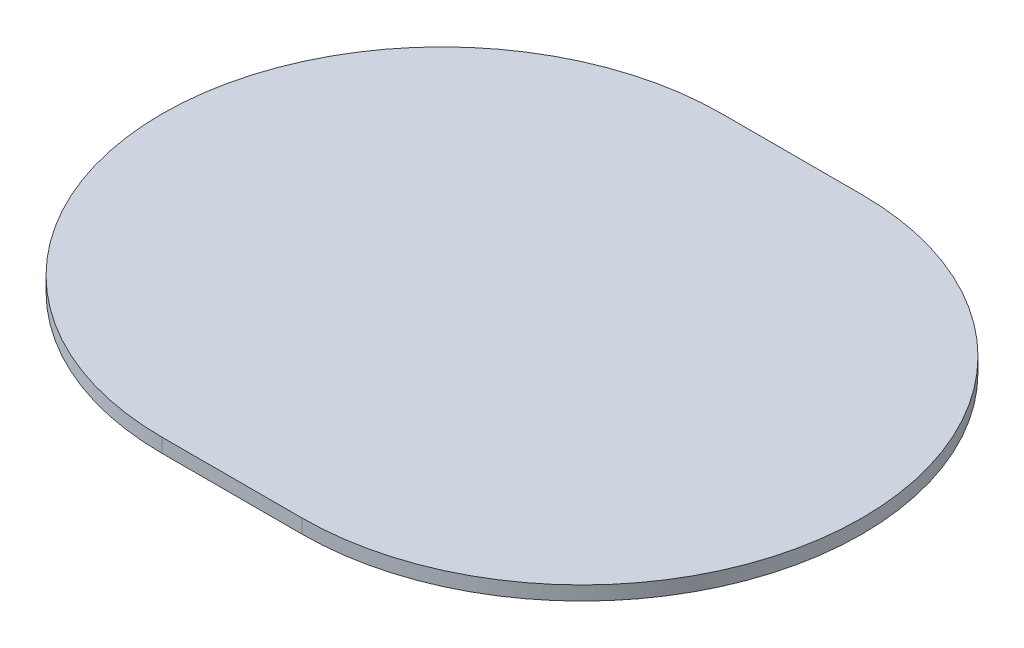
from build123d import *

# Parameters (mm, degrees)
BOSS_EXTRUDE1_DEPTH = 100


with BuildPart() as part:
    # Sketch1 → Boss-Extrude1 (new body)
    with BuildSketch(Plane(origin=(0, 0, 0), x_dir=(1, 0, 0), z_dir=(0, 1, 0))):
        with BuildLine():
            Line((-500, 2000), (500, 2000))
            ThreePointArc((500, 2000), (2500, 0), (500, -2000))
            Line((500, -2000), (-500, -2000))
            ThreePointArc((-500, -2000), (-2500, 0), (-500, 2000))
        make_face()
    extrude(amount=-BOSS_EXTRUDE1_DEPTH)


solid = part.part
